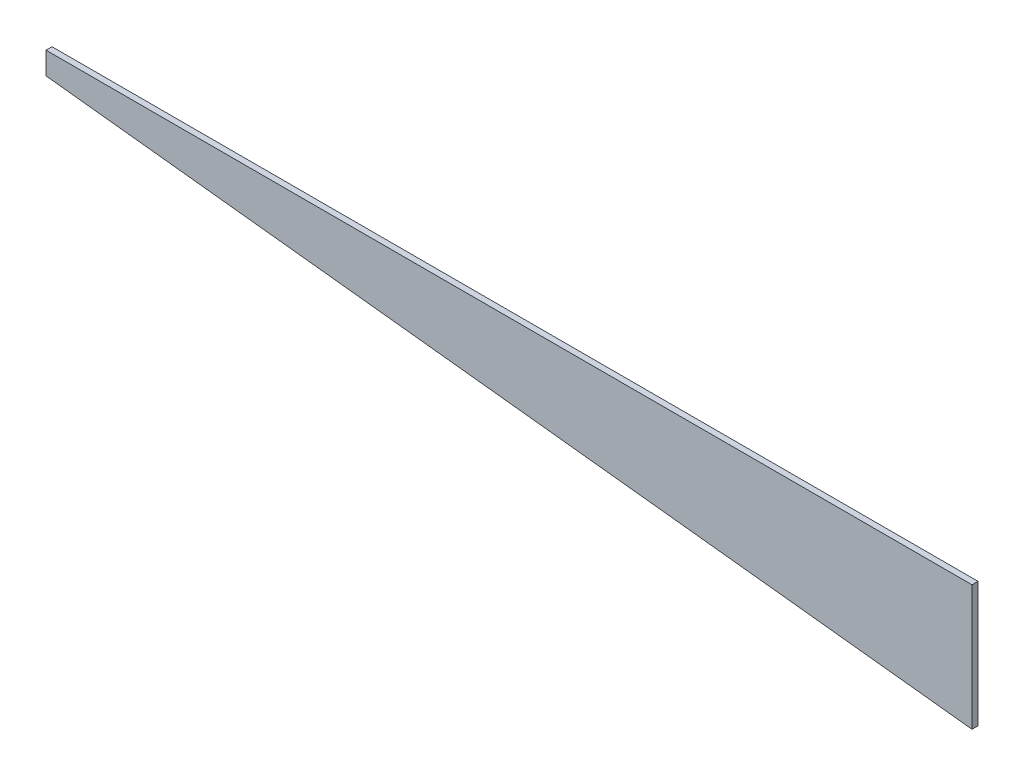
from build123d import *

# Parameters (mm, degrees)
BOSS_EXTRUDE1_DEPTH = 5
SKETCH6_W           = 771.525
SKETCH6_H           = 10
CUT_EXTRUDE3_DEPTH  = 780.961739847


with BuildPart() as part:
    # Sketch3 → Boss-Extrude1 (new body)
    with BuildSketch(Plane.XY):
        Polygon((-771.525, 0), (-771.525, -28.575), (0, -114.3), (0, 0), align=None)
    extrude(amount=BOSS_EXTRUDE1_DEPTH)

    # Sketch6 → Cut-Extrude3 (cut, through all)
    with BuildSketch(Plane.XY.offset(5)):
        with Locations((-385.7625, -5)):
            Rectangle(SKETCH6_W, SKETCH6_H)
    extrude(amount=-CUT_EXTRUDE3_DEPTH, mode=Mode.SUBTRACT)


solid = part.part
